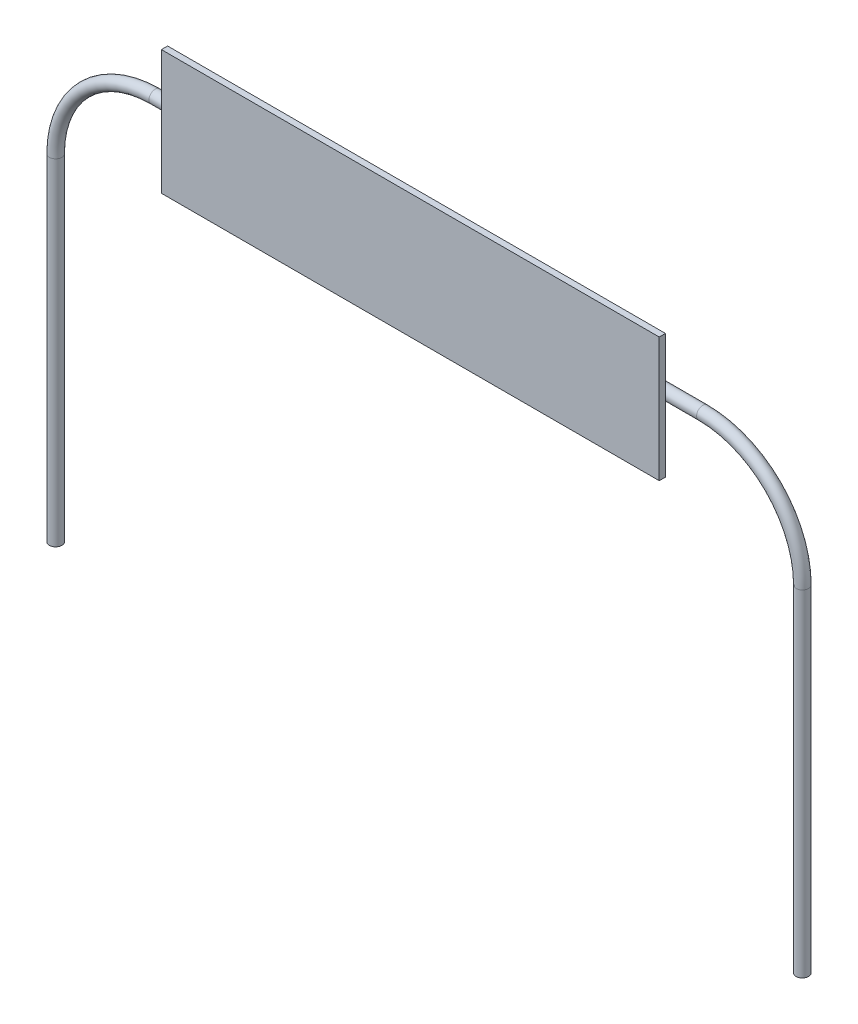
ISO-10303-21;
HEADER;
FILE_DESCRIPTION(('STEP AP214'),'2;1');
FILE_NAME('part.step','',(''),(''),'','','');
FILE_SCHEMA(('AUTOMOTIVE_DESIGN { 1 0 10303 214 1 1 1 1 }'));
ENDSEC;
DATA;
#1=APPLICATION_CONTEXT('core data for automotive mechanical design processes');
#2=APPLICATION_PROTOCOL_DEFINITION('international standard','automotive_design',2000,#1);
#3=PRODUCT_CONTEXT('',#1,'mechanical');
#4=PRODUCT('Part','Part','',(#3));
#5=PRODUCT_RELATED_PRODUCT_CATEGORY('part','',(#4));
#6=PRODUCT_DEFINITION_FORMATION('','',#4);
#7=PRODUCT_DEFINITION_CONTEXT('part definition',#1,'design');
#8=PRODUCT_DEFINITION('design','',#6,#7);
#9=PRODUCT_DEFINITION_SHAPE('','',#8);
#10=(LENGTH_UNIT() NAMED_UNIT(*) SI_UNIT(.MILLI.,.METRE.));
#11=(NAMED_UNIT(*) PLANE_ANGLE_UNIT() SI_UNIT($,.RADIAN.));
#12=(NAMED_UNIT(*) SI_UNIT($,.STERADIAN.) SOLID_ANGLE_UNIT());
#13=UNCERTAINTY_MEASURE_WITH_UNIT(LENGTH_MEASURE(1.E-05),#10,'distance_accuracy_value','');
#14=(GEOMETRIC_REPRESENTATION_CONTEXT(3) GLOBAL_UNCERTAINTY_ASSIGNED_CONTEXT((#13)) GLOBAL_UNIT_ASSIGNED_CONTEXT((#10,
#11,#12)) REPRESENTATION_CONTEXT('',''));
#15=CARTESIAN_POINT('',(0.,0.,0.));
#16=DIRECTION('',(0.,0.,1.));
#17=DIRECTION('',(1.,0.,0.));
#18=AXIS2_PLACEMENT_3D('',#15,#16,#17);
#19=CARTESIAN_POINT('',(-2895.6,-274.319999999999,30.4800000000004));
#20=DIRECTION('',(1.,0.,0.));
#21=DIRECTION('',(0.,0.,1.));
#22=AXIS2_PLACEMENT_3D('',#19,#20,#21);
#23=CYLINDRICAL_SURFACE('',#22,121.92);
#24=CARTESIAN_POINT('',(-2438.4,-274.319999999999,30.4800000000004));
#25=DIRECTION('',(1.,0.,0.));
#26=DIRECTION('',(0.,0.,-1.));
#27=AXIS2_PLACEMENT_3D('',#24,#25,#26);
#28=CIRCLE('',#27,121.92);
#29=CARTESIAN_POINT('',(-2438.4,-152.399999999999,30.4800000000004));
#30=VERTEX_POINT('',#29);
#31=CARTESIAN_POINT('',(-2438.4,-274.319999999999,152.4));
#32=VERTEX_POINT('',#31);
#33=EDGE_CURVE('E192',#30,#32,#28,.T.);
#34=ORIENTED_EDGE('',*,*,#33,.F.);
#35=DIRECTION('',(1.,0.,0.));
#36=VECTOR('',#35,1.);
#37=CARTESIAN_POINT('',(-2895.6,-152.399999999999,30.4800000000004));
#38=LINE('',#37,#36);
#39=CARTESIAN_POINT('',(-2895.6,-152.399999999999,30.4800000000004));
#40=VERTEX_POINT('',#39);
#41=EDGE_CURVE('E191',#40,#30,#38,.T.);
#42=ORIENTED_EDGE('',*,*,#41,.F.);
#43=CARTESIAN_POINT('',(-2895.6,-274.319999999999,30.4800000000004));
#44=DIRECTION('',(1.,0.,0.));
#45=DIRECTION('',(0.,0.,-1.));
#46=AXIS2_PLACEMENT_3D('',#43,#44,#45);
#47=CIRCLE('',#46,121.92);
#48=CARTESIAN_POINT('',(-2895.6,-274.319999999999,152.4));
#49=VERTEX_POINT('',#48);
#50=EDGE_CURVE('E234',#40,#49,#47,.T.);
#51=ORIENTED_EDGE('',*,*,#50,.T.);
#52=DIRECTION('',(1.,0.,0.));
#53=VECTOR('',#52,1.);
#54=CARTESIAN_POINT('',(-2895.6,-274.319999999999,152.4));
#55=LINE('',#54,#53);
#56=EDGE_CURVE('E12',#49,#32,#55,.T.);
#57=ORIENTED_EDGE('',*,*,#56,.T.);
#58=EDGE_LOOP('',(#34,#42,#51,#57));
#59=FACE_BOUND('',#58,.T.);
#60=ADVANCED_FACE('F48',(#59),#23,.T.);
#61=CARTESIAN_POINT('',(-2895.6,-274.319999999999,152.4));
#62=DIRECTION('',(0.,0.,-1.));
#63=DIRECTION('',(1.,0.,0.));
#64=AXIS2_PLACEMENT_3D('',#61,#62,#63);
#65=PLANE('',#64);
#66=DIRECTION('',(0.,-1.,0.));
#67=VECTOR('',#66,1.);
#68=CARTESIAN_POINT('',(-2438.4,-274.319999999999,152.4));
#69=LINE('',#68,#67);
#70=CARTESIAN_POINT('',(-2438.4,-457.199999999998,152.4));
#71=VERTEX_POINT('',#70);
#72=EDGE_CURVE('E194',#32,#71,#69,.T.);
#73=ORIENTED_EDGE('',*,*,#72,.F.);
#74=ORIENTED_EDGE('',*,*,#56,.F.);
#75=DIRECTION('',(0.,-1.,0.));
#76=VECTOR('',#75,1.);
#77=CARTESIAN_POINT('',(-2895.6,-274.319999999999,152.4));
#78=LINE('',#77,#76);
#79=CARTESIAN_POINT('',(-2895.6,-457.199999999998,152.4));
#80=VERTEX_POINT('',#79);
#81=EDGE_CURVE('E126',#49,#80,#78,.T.);
#82=ORIENTED_EDGE('',*,*,#81,.T.);
#83=DIRECTION('',(1.,0.,0.));
#84=VECTOR('',#83,1.);
#85=CARTESIAN_POINT('',(-2895.6,-457.199999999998,152.4));
#86=LINE('',#85,#84);
#87=EDGE_CURVE('E56',#80,#71,#86,.T.);
#88=ORIENTED_EDGE('',*,*,#87,.T.);
#89=EDGE_LOOP('',(#73,#74,#82,#88));
#90=FACE_BOUND('',#89,.T.);
#91=ADVANCED_FACE('F270',(#90),#65,.F.);
#92=CARTESIAN_POINT('',(-2895.6,-457.199999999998,60.9600000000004));
#93=DIRECTION('',(0.,1.,0.));
#94=DIRECTION('',(0.,0.,1.));
#95=AXIS2_PLACEMENT_3D('',#92,#93,#94);
#96=PLANE('',#95);
#97=DIRECTION('',(0.,0.,-1.));
#98=VECTOR('',#97,1.);
#99=CARTESIAN_POINT('',(-2438.4,-457.199999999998,60.9600000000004));
#100=LINE('',#99,#98);
#101=CARTESIAN_POINT('',(-2438.4,-457.199999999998,60.9600000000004));
#102=VERTEX_POINT('',#101);
#103=EDGE_CURVE('E197',#71,#102,#100,.T.);
#104=ORIENTED_EDGE('',*,*,#103,.F.);
#105=ORIENTED_EDGE('',*,*,#87,.F.);
#106=DIRECTION('',(0.,0.,-1.));
#107=VECTOR('',#106,1.);
#108=CARTESIAN_POINT('',(-2895.6,-457.199999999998,60.9600000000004));
#109=LINE('',#108,#107);
#110=CARTESIAN_POINT('',(-2895.6,-457.199999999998,60.9600000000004));
#111=VERTEX_POINT('',#110);
#112=EDGE_CURVE('E279',#80,#111,#109,.T.);
#113=ORIENTED_EDGE('',*,*,#112,.T.);
#114=DIRECTION('',(1.,0.,0.));
#115=VECTOR('',#114,1.);
#116=CARTESIAN_POINT('',(-2895.6,-457.199999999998,60.9600000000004));
#117=LINE('',#116,#115);
#118=EDGE_CURVE('E265',#111,#102,#117,.T.);
#119=ORIENTED_EDGE('',*,*,#118,.T.);
#120=EDGE_LOOP('',(#104,#105,#113,#119));
#121=FACE_BOUND('',#120,.T.);
#122=ADVANCED_FACE('F337',(#121),#96,.F.);
#123=CARTESIAN_POINT('',(-2895.6,-274.319999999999,60.9600000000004));
#124=DIRECTION('',(0.,0.,1.));
#125=DIRECTION('',(-1.,0.,0.));
#126=AXIS2_PLACEMENT_3D('',#123,#124,#125);
#127=PLANE('',#126);
#128=DIRECTION('',(0.,1.,0.));
#129=VECTOR('',#128,1.);
#130=CARTESIAN_POINT('',(-2438.4,-274.319999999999,60.9600000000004));
#131=LINE('',#130,#129);
#132=CARTESIAN_POINT('',(-2438.4,-274.319999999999,60.9600000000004));
#133=VERTEX_POINT('',#132);
#134=EDGE_CURVE('E200',#102,#133,#131,.T.);
#135=ORIENTED_EDGE('',*,*,#134,.F.);
#136=ORIENTED_EDGE('',*,*,#118,.F.);
#137=DIRECTION('',(0.,1.,0.));
#138=VECTOR('',#137,1.);
#139=CARTESIAN_POINT('',(-2895.6,-274.319999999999,60.9600000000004));
#140=LINE('',#139,#138);
#141=CARTESIAN_POINT('',(-2895.6,-274.319999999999,60.9600000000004));
#142=VERTEX_POINT('',#141);
#143=EDGE_CURVE('E283',#111,#142,#140,.T.);
#144=ORIENTED_EDGE('',*,*,#143,.T.);
#145=DIRECTION('',(1.,0.,0.));
#146=VECTOR('',#145,1.);
#147=CARTESIAN_POINT('',(-2895.6,-274.319999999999,60.9600000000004));
#148=LINE('',#147,#146);
#149=EDGE_CURVE('E262',#142,#133,#148,.T.);
#150=ORIENTED_EDGE('',*,*,#149,.T.);
#151=EDGE_LOOP('',(#135,#136,#144,#150));
#152=FACE_BOUND('',#151,.T.);
#153=ADVANCED_FACE('F336',(#152),#127,.F.);
#154=CARTESIAN_POINT('',(-2895.6,-274.319999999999,30.4800000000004));
#155=DIRECTION('',(1.,0.,0.));
#156=DIRECTION('',(0.,0.,1.));
#157=AXIS2_PLACEMENT_3D('',#154,#155,#156);
#158=CYLINDRICAL_SURFACE('',#157,30.48);
#159=CARTESIAN_POINT('',(-2438.4,-274.319999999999,30.4800000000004));
#160=DIRECTION('',(-1.,0.,0.));
#161=DIRECTION('',(0.,0.,-1.));
#162=AXIS2_PLACEMENT_3D('',#159,#160,#161);
#163=CIRCLE('',#162,30.48);
#164=CARTESIAN_POINT('',(-2438.4,-243.839999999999,30.4800000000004));
#165=VERTEX_POINT('',#164);
#166=EDGE_CURVE('E203',#133,#165,#163,.T.);
#167=ORIENTED_EDGE('',*,*,#166,.F.);
#168=ORIENTED_EDGE('',*,*,#149,.F.);
#169=CARTESIAN_POINT('',(-2895.6,-274.319999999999,30.4800000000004));
#170=DIRECTION('',(-1.,0.,0.));
#171=DIRECTION('',(0.,0.,-1.));
#172=AXIS2_PLACEMENT_3D('',#169,#170,#171);
#173=CIRCLE('',#172,30.48);
#174=CARTESIAN_POINT('',(-2895.6,-243.839999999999,30.4800000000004));
#175=VERTEX_POINT('',#174);
#176=EDGE_CURVE('E286',#142,#175,#173,.T.);
#177=ORIENTED_EDGE('',*,*,#176,.T.);
#178=DIRECTION('',(1.,0.,0.));
#179=VECTOR('',#178,1.);
#180=CARTESIAN_POINT('',(-2895.6,-243.839999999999,30.4800000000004));
#181=LINE('',#180,#179);
#182=EDGE_CURVE('E259',#175,#165,#181,.T.);
#183=ORIENTED_EDGE('',*,*,#182,.T.);
#184=EDGE_LOOP('',(#167,#168,#177,#183));
#185=FACE_BOUND('',#184,.T.);
#186=ADVANCED_FACE('F333',(#185),#158,.F.);
#187=CARTESIAN_POINT('',(-2895.6,-243.839999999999,0.));
#188=DIRECTION('',(0.,1.,0.));
#189=DIRECTION('',(0.,0.,1.));
#190=AXIS2_PLACEMENT_3D('',#187,#188,#189);
#191=PLANE('',#190);
#192=DIRECTION('',(0.,0.,-1.));
#193=VECTOR('',#192,1.);
#194=CARTESIAN_POINT('',(-2438.4,-243.839999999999,0.));
#195=LINE('',#194,#193);
#196=CARTESIAN_POINT('',(-2438.4,-243.84,0.));
#197=VERTEX_POINT('',#196);
#198=EDGE_CURVE('E206',#165,#197,#195,.T.);
#199=ORIENTED_EDGE('',*,*,#198,.F.);
#200=ORIENTED_EDGE('',*,*,#182,.F.);
#201=DIRECTION('',(0.,0.,-1.));
#202=VECTOR('',#201,1.);
#203=CARTESIAN_POINT('',(-2895.6,-243.839999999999,0.));
#204=LINE('',#203,#202);
#205=CARTESIAN_POINT('',(-2895.6,-243.84,0.));
#206=VERTEX_POINT('',#205);
#207=EDGE_CURVE('E289',#175,#206,#204,.T.);
#208=ORIENTED_EDGE('',*,*,#207,.T.);
#209=DIRECTION('',(1.,0.,0.));
#210=VECTOR('',#209,1.);
#211=CARTESIAN_POINT('',(-2895.6,-243.84,0.));
#212=LINE('',#211,#210);
#213=EDGE_CURVE('E256',#206,#197,#212,.T.);
#214=ORIENTED_EDGE('',*,*,#213,.T.);
#215=EDGE_LOOP('',(#199,#200,#208,#214));
#216=FACE_BOUND('',#215,.T.);
#217=ADVANCED_FACE('F331',(#216),#191,.F.);
#218=CARTESIAN_POINT('',(-2895.6,-1.77635683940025E-12,0.));
#219=DIRECTION('',(1.,0.,0.));
#220=DIRECTION('',(0.,0.,1.));
#221=AXIS2_PLACEMENT_3D('',#218,#219,#220);
#222=CYLINDRICAL_SURFACE('',#221,243.839999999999);
#223=CARTESIAN_POINT('',(-2438.4,-1.77635683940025E-12,0.));
#224=DIRECTION('',(1.,0.,0.));
#225=DIRECTION('',(0.,0.,-1.));
#226=AXIS2_PLACEMENT_3D('',#223,#224,#225);
#227=CIRCLE('',#226,243.839999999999);
#228=CARTESIAN_POINT('',(-2438.4,243.839999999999,0.));
#229=VERTEX_POINT('',#228);
#230=EDGE_CURVE('E209',#197,#229,#227,.T.);
#231=ORIENTED_EDGE('',*,*,#230,.F.);
#232=ORIENTED_EDGE('',*,*,#213,.F.);
#233=CARTESIAN_POINT('',(-2895.6,-1.77635683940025E-12,0.));
#234=DIRECTION('',(1.,0.,0.));
#235=DIRECTION('',(0.,0.,-1.));
#236=AXIS2_PLACEMENT_3D('',#233,#234,#235);
#237=CIRCLE('',#236,243.839999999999);
#238=CARTESIAN_POINT('',(-2895.6,243.839999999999,0.));
#239=VERTEX_POINT('',#238);
#240=EDGE_CURVE('E292',#206,#239,#237,.T.);
#241=ORIENTED_EDGE('',*,*,#240,.T.);
#242=DIRECTION('',(1.,0.,0.));
#243=VECTOR('',#242,1.);
#244=CARTESIAN_POINT('',(-2895.6,243.839999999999,0.));
#245=LINE('',#244,#243);
#246=EDGE_CURVE('E253',#239,#229,#245,.T.);
#247=ORIENTED_EDGE('',*,*,#246,.T.);
#248=EDGE_LOOP('',(#231,#232,#241,#247));
#249=FACE_BOUND('',#248,.T.);
#250=ADVANCED_FACE('F327',(#249),#222,.T.);
#251=CARTESIAN_POINT('',(-2895.6,243.839999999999,0.));
#252=DIRECTION('',(0.,-1.,0.));
#253=DIRECTION('',(0.,0.,-1.));
#254=AXIS2_PLACEMENT_3D('',#251,#252,#253);
#255=PLANE('',#254);
#256=DIRECTION('',(0.,0.,1.));
#257=VECTOR('',#256,1.);
#258=CARTESIAN_POINT('',(-2438.4,243.839999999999,0.));
#259=LINE('',#258,#257);
#260=CARTESIAN_POINT('',(-2438.4,243.839999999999,182.88));
#261=VERTEX_POINT('',#260);
#262=EDGE_CURVE('E212',#229,#261,#259,.T.);
#263=ORIENTED_EDGE('',*,*,#262,.F.);
#264=ORIENTED_EDGE('',*,*,#246,.F.);
#265=DIRECTION('',(0.,0.,1.));
#266=VECTOR('',#265,1.);
#267=CARTESIAN_POINT('',(-2895.6,243.839999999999,0.));
#268=LINE('',#267,#266);
#269=CARTESIAN_POINT('',(-2895.6,243.839999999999,182.88));
#270=VERTEX_POINT('',#269);
#271=EDGE_CURVE('E295',#239,#270,#268,.T.);
#272=ORIENTED_EDGE('',*,*,#271,.T.);
#273=DIRECTION('',(1.,0.,0.));
#274=VECTOR('',#273,1.);
#275=CARTESIAN_POINT('',(-2895.6,243.839999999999,182.88));
#276=LINE('',#275,#274);
#277=EDGE_CURVE('E250',#270,#261,#276,.T.);
#278=ORIENTED_EDGE('',*,*,#277,.T.);
#279=EDGE_LOOP('',(#263,#264,#272,#278));
#280=FACE_BOUND('',#279,.T.);
#281=ADVANCED_FACE('F324',(#280),#255,.F.);
#282=CARTESIAN_POINT('',(-2895.6,274.319999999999,182.88));
#283=DIRECTION('',(1.,0.,0.));
#284=DIRECTION('',(0.,0.,1.));
#285=AXIS2_PLACEMENT_3D('',#282,#283,#284);
#286=CYLINDRICAL_SURFACE('',#285,30.48);
#287=CARTESIAN_POINT('',(-2438.4,274.319999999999,182.88));
#288=DIRECTION('',(-1.,0.,0.));
#289=DIRECTION('',(0.,0.,1.));
#290=AXIS2_PLACEMENT_3D('',#287,#288,#289);
#291=CIRCLE('',#290,30.48);
#292=CARTESIAN_POINT('',(-2438.4,274.319999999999,213.36));
#293=VERTEX_POINT('',#292);
#294=EDGE_CURVE('E215',#261,#293,#291,.T.);
#295=ORIENTED_EDGE('',*,*,#294,.F.);
#296=ORIENTED_EDGE('',*,*,#277,.F.);
#297=CARTESIAN_POINT('',(-2895.6,274.319999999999,182.88));
#298=DIRECTION('',(-1.,0.,0.));
#299=DIRECTION('',(0.,0.,1.));
#300=AXIS2_PLACEMENT_3D('',#297,#298,#299);
#301=CIRCLE('',#300,30.48);
#302=CARTESIAN_POINT('',(-2895.6,274.319999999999,213.36));
#303=VERTEX_POINT('',#302);
#304=EDGE_CURVE('E298',#270,#303,#301,.T.);
#305=ORIENTED_EDGE('',*,*,#304,.T.);
#306=DIRECTION('',(1.,0.,0.));
#307=VECTOR('',#306,1.);
#308=CARTESIAN_POINT('',(-2895.6,274.319999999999,213.36));
#309=LINE('',#308,#307);
#310=EDGE_CURVE('E247',#303,#293,#309,.T.);
#311=ORIENTED_EDGE('',*,*,#310,.T.);
#312=EDGE_LOOP('',(#295,#296,#305,#311));
#313=FACE_BOUND('',#312,.T.);
#314=ADVANCED_FACE('F322',(#313),#286,.F.);
#315=CARTESIAN_POINT('',(-2895.6,274.319999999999,213.36));
#316=DIRECTION('',(0.,0.,1.));
#317=DIRECTION('',(-1.,0.,0.));
#318=AXIS2_PLACEMENT_3D('',#315,#316,#317);
#319=PLANE('',#318);
#320=DIRECTION('',(0.,1.,0.));
#321=VECTOR('',#320,1.);
#322=CARTESIAN_POINT('',(-2438.4,274.319999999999,213.36));
#323=LINE('',#322,#321);
#324=CARTESIAN_POINT('',(-2438.4,457.199999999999,213.36));
#325=VERTEX_POINT('',#324);
#326=EDGE_CURVE('E218',#293,#325,#323,.T.);
#327=ORIENTED_EDGE('',*,*,#326,.F.);
#328=ORIENTED_EDGE('',*,*,#310,.F.);
#329=DIRECTION('',(0.,1.,0.));
#330=VECTOR('',#329,1.);
#331=CARTESIAN_POINT('',(-2895.6,274.319999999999,213.36));
#332=LINE('',#331,#330);
#333=CARTESIAN_POINT('',(-2895.6,457.199999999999,213.36));
#334=VERTEX_POINT('',#333);
#335=EDGE_CURVE('E301',#303,#334,#332,.T.);
#336=ORIENTED_EDGE('',*,*,#335,.T.);
#337=DIRECTION('',(1.,0.,0.));
#338=VECTOR('',#337,1.);
#339=CARTESIAN_POINT('',(-2895.6,457.199999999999,213.36));
#340=LINE('',#339,#338);
#341=EDGE_CURVE('E244',#334,#325,#340,.T.);
#342=ORIENTED_EDGE('',*,*,#341,.T.);
#343=EDGE_LOOP('',(#327,#328,#336,#342));
#344=FACE_BOUND('',#343,.T.);
#345=ADVANCED_FACE('F318',(#344),#319,.F.);
#346=CARTESIAN_POINT('',(-2895.6,457.199999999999,213.36));
#347=DIRECTION('',(0.,-1.,0.));
#348=DIRECTION('',(0.,0.,-1.));
#349=AXIS2_PLACEMENT_3D('',#346,#347,#348);
#350=PLANE('',#349);
#351=DIRECTION('',(0.,0.,1.));
#352=VECTOR('',#351,1.);
#353=CARTESIAN_POINT('',(-2438.4,457.199999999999,213.36));
#354=LINE('',#353,#352);
#355=CARTESIAN_POINT('',(-2438.4,457.199999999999,304.8));
#356=VERTEX_POINT('',#355);
#357=EDGE_CURVE('E221',#325,#356,#354,.T.);
#358=ORIENTED_EDGE('',*,*,#357,.F.);
#359=ORIENTED_EDGE('',*,*,#341,.F.);
#360=DIRECTION('',(0.,0.,1.));
#361=VECTOR('',#360,1.);
#362=CARTESIAN_POINT('',(-2895.6,457.199999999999,213.36));
#363=LINE('',#362,#361);
#364=CARTESIAN_POINT('',(-2895.6,457.199999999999,304.8));
#365=VERTEX_POINT('',#364);
#366=EDGE_CURVE('E304',#334,#365,#363,.T.);
#367=ORIENTED_EDGE('',*,*,#366,.T.);
#368=DIRECTION('',(1.,0.,0.));
#369=VECTOR('',#368,1.);
#370=CARTESIAN_POINT('',(-2895.6,457.199999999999,304.8));
#371=LINE('',#370,#369);
#372=EDGE_CURVE('E241',#365,#356,#371,.T.);
#373=ORIENTED_EDGE('',*,*,#372,.T.);
#374=EDGE_LOOP('',(#358,#359,#367,#373));
#375=FACE_BOUND('',#374,.T.);
#376=ADVANCED_FACE('F315',(#375),#350,.F.);
#377=CARTESIAN_POINT('',(-2895.6,274.319999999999,304.8));
#378=DIRECTION('',(0.,0.,-1.));
#379=DIRECTION('',(0.,1.,0.));
#380=AXIS2_PLACEMENT_3D('',#377,#378,#379);
#381=PLANE('',#380);
#382=DIRECTION('',(0.,-1.,0.));
#383=VECTOR('',#382,1.);
#384=CARTESIAN_POINT('',(-2438.4,274.319999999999,304.8));
#385=LINE('',#384,#383);
#386=CARTESIAN_POINT('',(-2438.4,274.319999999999,304.8));
#387=VERTEX_POINT('',#386);
#388=EDGE_CURVE('E224',#356,#387,#385,.T.);
#389=ORIENTED_EDGE('',*,*,#388,.F.);
#390=ORIENTED_EDGE('',*,*,#372,.F.);
#391=DIRECTION('',(0.,-1.,0.));
#392=VECTOR('',#391,1.);
#393=CARTESIAN_POINT('',(-2895.6,274.319999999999,304.8));
#394=LINE('',#393,#392);
#395=CARTESIAN_POINT('',(-2895.6,274.319999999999,304.8));
#396=VERTEX_POINT('',#395);
#397=EDGE_CURVE('E186',#365,#396,#394,.T.);
#398=ORIENTED_EDGE('',*,*,#397,.T.);
#399=DIRECTION('',(1.,0.,0.));
#400=VECTOR('',#399,1.);
#401=CARTESIAN_POINT('',(-2895.6,274.319999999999,304.8));
#402=LINE('',#401,#400);
#403=EDGE_CURVE('E238',#396,#387,#402,.T.);
#404=ORIENTED_EDGE('',*,*,#403,.T.);
#405=EDGE_LOOP('',(#389,#390,#398,#404));
#406=FACE_BOUND('',#405,.T.);
#407=ADVANCED_FACE('F309',(#406),#381,.F.);
#408=CARTESIAN_POINT('',(-2895.6,274.319999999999,182.88));
#409=DIRECTION('',(1.,0.,0.));
#410=DIRECTION('',(0.,0.,1.));
#411=AXIS2_PLACEMENT_3D('',#408,#409,#410);
#412=CYLINDRICAL_SURFACE('',#411,121.92);
#413=CARTESIAN_POINT('',(-2438.4,274.319999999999,182.88));
#414=DIRECTION('',(1.,0.,0.));
#415=DIRECTION('',(0.,0.,1.));
#416=AXIS2_PLACEMENT_3D('',#413,#414,#415);
#417=CIRCLE('',#416,121.92);
#418=CARTESIAN_POINT('',(-2438.4,152.399999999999,182.88));
#419=VERTEX_POINT('',#418);
#420=EDGE_CURVE('E227',#387,#419,#417,.T.);
#421=ORIENTED_EDGE('',*,*,#420,.F.);
#422=ORIENTED_EDGE('',*,*,#403,.F.);
#423=CARTESIAN_POINT('',(-2895.6,274.319999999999,182.88));
#424=DIRECTION('',(1.,0.,0.));
#425=DIRECTION('',(0.,0.,1.));
#426=AXIS2_PLACEMENT_3D('',#423,#424,#425);
#427=CIRCLE('',#426,121.92);
#428=CARTESIAN_POINT('',(-2895.6,152.399999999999,182.88));
#429=VERTEX_POINT('',#428);
#430=EDGE_CURVE('E184',#396,#429,#427,.T.);
#431=ORIENTED_EDGE('',*,*,#430,.T.);
#432=DIRECTION('',(1.,0.,0.));
#433=VECTOR('',#432,1.);
#434=CARTESIAN_POINT('',(-2895.6,152.399999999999,182.88));
#435=LINE('',#434,#433);
#436=EDGE_CURVE('E178',#429,#419,#435,.T.);
#437=ORIENTED_EDGE('',*,*,#436,.T.);
#438=EDGE_LOOP('',(#421,#422,#431,#437));
#439=FACE_BOUND('',#438,.T.);
#440=ADVANCED_FACE('F313',(#439),#412,.T.);
#441=CARTESIAN_POINT('',(-2895.6,152.399999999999,0.));
#442=DIRECTION('',(0.,1.,0.));
#443=DIRECTION('',(0.,0.,1.));
#444=AXIS2_PLACEMENT_3D('',#441,#442,#443);
#445=PLANE('',#444);
#446=DIRECTION('',(0.,0.,-1.));
#447=VECTOR('',#446,1.);
#448=CARTESIAN_POINT('',(-2438.4,152.399999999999,0.));
#449=LINE('',#448,#447);
#450=CARTESIAN_POINT('',(-2438.4,152.399999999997,0.));
#451=VERTEX_POINT('',#450);
#452=EDGE_CURVE('E230',#419,#451,#449,.T.);
#453=ORIENTED_EDGE('',*,*,#452,.F.);
#454=ORIENTED_EDGE('',*,*,#436,.F.);
#455=DIRECTION('',(0.,0.,-1.));
#456=VECTOR('',#455,1.);
#457=CARTESIAN_POINT('',(-2895.6,152.399999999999,0.));
#458=LINE('',#457,#456);
#459=CARTESIAN_POINT('',(-2895.6,152.399999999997,0.));
#460=VERTEX_POINT('',#459);
#461=EDGE_CURVE('E168',#429,#460,#458,.T.);
#462=ORIENTED_EDGE('',*,*,#461,.T.);
#463=DIRECTION('',(1.,0.,0.));
#464=VECTOR('',#463,1.);
#465=CARTESIAN_POINT('',(-2895.6,152.399999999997,0.));
#466=LINE('',#465,#464);
#467=EDGE_CURVE('E173',#460,#451,#466,.T.);
#468=ORIENTED_EDGE('',*,*,#467,.T.);
#469=EDGE_LOOP('',(#453,#454,#462,#468));
#470=FACE_BOUND('',#469,.T.);
#471=ADVANCED_FACE('F181',(#470),#445,.F.);
#472=CARTESIAN_POINT('',(-2895.6,-1.77635683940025E-12,0.));
#473=DIRECTION('',(1.,0.,0.));
#474=DIRECTION('',(0.,0.,1.));
#475=AXIS2_PLACEMENT_3D('',#472,#473,#474);
#476=CYLINDRICAL_SURFACE('',#475,152.399999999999);
#477=CARTESIAN_POINT('',(-2438.4,-1.77635683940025E-12,0.));
#478=DIRECTION('',(-1.,0.,0.));
#479=DIRECTION('',(0.,0.,-1.));
#480=AXIS2_PLACEMENT_3D('',#477,#478,#479);
#481=CIRCLE('',#480,152.399999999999);
#482=CARTESIAN_POINT('',(-2438.4,-152.399999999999,0.));
#483=VERTEX_POINT('',#482);
#484=EDGE_CURVE('E175',#451,#483,#481,.T.);
#485=ORIENTED_EDGE('',*,*,#484,.F.);
#486=ORIENTED_EDGE('',*,*,#467,.F.);
#487=CARTESIAN_POINT('',(-2895.6,-1.77635683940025E-12,0.));
#488=DIRECTION('',(-1.,0.,0.));
#489=DIRECTION('',(0.,0.,-1.));
#490=AXIS2_PLACEMENT_3D('',#487,#488,#489);
#491=CIRCLE('',#490,152.399999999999);
#492=CARTESIAN_POINT('',(-2895.6,-152.399999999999,0.));
#493=VERTEX_POINT('',#492);
#494=EDGE_CURVE('E164',#460,#493,#491,.T.);
#495=ORIENTED_EDGE('',*,*,#494,.T.);
#496=DIRECTION('',(1.,0.,0.));
#497=VECTOR('',#496,1.);
#498=CARTESIAN_POINT('',(-2895.6,-152.399999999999,0.));
#499=LINE('',#498,#497);
#500=EDGE_CURVE('E179',#493,#483,#499,.T.);
#501=ORIENTED_EDGE('',*,*,#500,.T.);
#502=EDGE_LOOP('',(#485,#486,#495,#501));
#503=FACE_BOUND('',#502,.T.);
#504=ADVANCED_FACE('F174',(#503),#476,.F.);
#505=CARTESIAN_POINT('',(-2895.6,-152.399999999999,0.));
#506=DIRECTION('',(0.,-1.,0.));
#507=DIRECTION('',(0.,0.,-1.));
#508=AXIS2_PLACEMENT_3D('',#505,#506,#507);
#509=PLANE('',#508);
#510=DIRECTION('',(0.,0.,1.));
#511=VECTOR('',#510,1.);
#512=CARTESIAN_POINT('',(-2438.4,-152.399999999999,0.));
#513=LINE('',#512,#511);
#514=EDGE_CURVE('E114',#483,#30,#513,.T.);
#515=ORIENTED_EDGE('',*,*,#514,.F.);
#516=ORIENTED_EDGE('',*,*,#500,.F.);
#517=DIRECTION('',(0.,0.,1.));
#518=VECTOR('',#517,1.);
#519=CARTESIAN_POINT('',(-2895.6,-152.399999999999,0.));
#520=LINE('',#519,#518);
#521=EDGE_CURVE('E64',#493,#40,#520,.T.);
#522=ORIENTED_EDGE('',*,*,#521,.T.);
#523=ORIENTED_EDGE('',*,*,#41,.T.);
#524=EDGE_LOOP('',(#515,#516,#522,#523));
#525=FACE_BOUND('',#524,.T.);
#526=ADVANCED_FACE('F467',(#525),#509,.F.);
#527=CARTESIAN_POINT('',(-2895.6,-274.319999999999,30.4800000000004));
#528=DIRECTION('',(-1.,0.,0.));
#529=DIRECTION('',(0.,0.,-1.));
#530=AXIS2_PLACEMENT_3D('',#527,#528,#529);
#531=PLANE('',#530);
#532=ORIENTED_EDGE('',*,*,#50,.F.);
#533=ORIENTED_EDGE('',*,*,#521,.F.);
#534=ORIENTED_EDGE('',*,*,#494,.F.);
#535=ORIENTED_EDGE('',*,*,#461,.F.);
#536=ORIENTED_EDGE('',*,*,#430,.F.);
#537=ORIENTED_EDGE('',*,*,#397,.F.);
#538=ORIENTED_EDGE('',*,*,#366,.F.);
#539=ORIENTED_EDGE('',*,*,#335,.F.);
#540=ORIENTED_EDGE('',*,*,#304,.F.);
#541=ORIENTED_EDGE('',*,*,#271,.F.);
#542=ORIENTED_EDGE('',*,*,#240,.F.);
#543=ORIENTED_EDGE('',*,*,#207,.F.);
#544=ORIENTED_EDGE('',*,*,#176,.F.);
#545=ORIENTED_EDGE('',*,*,#143,.F.);
#546=ORIENTED_EDGE('',*,*,#112,.F.);
#547=ORIENTED_EDGE('',*,*,#81,.F.);
#548=EDGE_LOOP('',(#532,#533,#534,#535,#536,#537,#538,#539,#540,#541,#542,#543,#544,#545,#546,#547));
#549=FACE_BOUND('',#548,.T.);
#550=ADVANCED_FACE('F166',(#549),#531,.T.);
#551=CARTESIAN_POINT('',(-2438.4,-274.319999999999,30.4800000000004));
#552=DIRECTION('',(-1.,0.,0.));
#553=DIRECTION('',(0.,0.,-1.));
#554=AXIS2_PLACEMENT_3D('',#551,#552,#553);
#555=PLANE('',#554);
#556=ORIENTED_EDGE('',*,*,#33,.T.);
#557=ORIENTED_EDGE('',*,*,#72,.T.);
#558=ORIENTED_EDGE('',*,*,#103,.T.);
#559=ORIENTED_EDGE('',*,*,#134,.T.);
#560=ORIENTED_EDGE('',*,*,#166,.T.);
#561=ORIENTED_EDGE('',*,*,#198,.T.);
#562=ORIENTED_EDGE('',*,*,#230,.T.);
#563=ORIENTED_EDGE('',*,*,#262,.T.);
#564=ORIENTED_EDGE('',*,*,#294,.T.);
#565=ORIENTED_EDGE('',*,*,#326,.T.);
#566=ORIENTED_EDGE('',*,*,#357,.T.);
#567=ORIENTED_EDGE('',*,*,#388,.T.);
#568=ORIENTED_EDGE('',*,*,#420,.T.);
#569=ORIENTED_EDGE('',*,*,#452,.T.);
#570=ORIENTED_EDGE('',*,*,#484,.T.);
#571=ORIENTED_EDGE('',*,*,#514,.T.);
#572=EDGE_LOOP('',(#556,#557,#558,#559,#560,#561,#562,#563,#564,#565,#566,#567,#568,#569,#570,#571));
#573=FACE_BOUND('',#572,.T.);
#574=ADVANCED_FACE('F273',(#573),#555,.F.);
#575=CLOSED_SHELL('',(#60,#91,#122,#153,#186,#217,#250,#281,#314,#345,#376,#407,#440,#471,#504,
#526,#550,#574));
#576=MANIFOLD_SOLID_BREP('B2',#575);
#577=CARTESIAN_POINT('',(2895.6,-274.319999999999,30.4800000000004));
#578=DIRECTION('',(-1.,0.,0.));
#579=DIRECTION('',(0.,0.,1.));
#580=AXIS2_PLACEMENT_3D('',#577,#578,#579);
#581=CYLINDRICAL_SURFACE('',#580,121.92);
#582=CARTESIAN_POINT('',(2438.4,-274.319999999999,30.4800000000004));
#583=DIRECTION('',(1.,0.,0.));
#584=DIRECTION('',(0.,0.,-1.));
#585=AXIS2_PLACEMENT_3D('',#582,#583,#584);
#586=CIRCLE('',#585,121.92);
#587=CARTESIAN_POINT('',(2438.4,-152.399999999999,30.4800000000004));
#588=VERTEX_POINT('',#587);
#589=CARTESIAN_POINT('',(2438.4,-274.319999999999,152.4));
#590=VERTEX_POINT('',#589);
#591=EDGE_CURVE('E668',#588,#590,#586,.T.);
#592=ORIENTED_EDGE('',*,*,#591,.T.);
#593=DIRECTION('',(-1.,0.,0.));
#594=VECTOR('',#593,1.);
#595=CARTESIAN_POINT('',(2895.6,-274.319999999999,152.4));
#596=LINE('',#595,#594);
#597=CARTESIAN_POINT('',(2895.6,-274.319999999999,152.4));
#598=VERTEX_POINT('',#597);
#599=EDGE_CURVE('E46',#598,#590,#596,.T.);
#600=ORIENTED_EDGE('',*,*,#599,.F.);
#601=CARTESIAN_POINT('',(2895.6,-274.319999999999,30.4800000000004));
#602=DIRECTION('',(1.,0.,0.));
#603=DIRECTION('',(0.,0.,-1.));
#604=AXIS2_PLACEMENT_3D('',#601,#602,#603);
#605=CIRCLE('',#604,121.92);
#606=CARTESIAN_POINT('',(2895.6,-152.399999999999,30.4800000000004));
#607=VERTEX_POINT('',#606);
#608=EDGE_CURVE('E698',#607,#598,#605,.T.);
#609=ORIENTED_EDGE('',*,*,#608,.F.);
#610=DIRECTION('',(-1.,0.,0.));
#611=VECTOR('',#610,1.);
#612=CARTESIAN_POINT('',(2895.6,-152.399999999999,30.4800000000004));
#613=LINE('',#612,#611);
#614=EDGE_CURVE('E664',#607,#588,#613,.T.);
#615=ORIENTED_EDGE('',*,*,#614,.T.);
#616=EDGE_LOOP('',(#592,#600,#609,#615));
#617=FACE_BOUND('',#616,.T.);
#618=ADVANCED_FACE('F524',(#617),#581,.T.);
#619=CARTESIAN_POINT('',(2895.6,-274.319999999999,152.4));
#620=DIRECTION('',(0.,0.,-1.));
#621=DIRECTION('',(-1.,0.,0.));
#622=AXIS2_PLACEMENT_3D('',#619,#620,#621);
#623=PLANE('',#622);
#624=DIRECTION('',(0.,-1.,0.));
#625=VECTOR('',#624,1.);
#626=CARTESIAN_POINT('',(2438.4,-274.319999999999,152.4));
#627=LINE('',#626,#625);
#628=CARTESIAN_POINT('',(2438.4,-457.199999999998,152.4));
#629=VERTEX_POINT('',#628);
#630=EDGE_CURVE('E671',#590,#629,#627,.T.);
#631=ORIENTED_EDGE('',*,*,#630,.T.);
#632=DIRECTION('',(-1.,0.,0.));
#633=VECTOR('',#632,1.);
#634=CARTESIAN_POINT('',(2895.6,-457.199999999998,152.4));
#635=LINE('',#634,#633);
#636=CARTESIAN_POINT('',(2895.6,-457.199999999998,152.4));
#637=VERTEX_POINT('',#636);
#638=EDGE_CURVE('E532',#637,#629,#635,.T.);
#639=ORIENTED_EDGE('',*,*,#638,.F.);
#640=DIRECTION('',(0.,-1.,0.));
#641=VECTOR('',#640,1.);
#642=CARTESIAN_POINT('',(2895.6,-274.319999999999,152.4));
#643=LINE('',#642,#641);
#644=EDGE_CURVE('E607',#598,#637,#643,.T.);
#645=ORIENTED_EDGE('',*,*,#644,.F.);
#646=ORIENTED_EDGE('',*,*,#599,.T.);
#647=EDGE_LOOP('',(#631,#639,#645,#646));
#648=FACE_BOUND('',#647,.T.);
#649=ADVANCED_FACE('F796',(#648),#623,.F.);
#650=CARTESIAN_POINT('',(2895.6,-457.199999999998,60.9600000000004));
#651=DIRECTION('',(0.,1.,0.));
#652=DIRECTION('',(0.,0.,1.));
#653=AXIS2_PLACEMENT_3D('',#650,#651,#652);
#654=PLANE('',#653);
#655=DIRECTION('',(0.,0.,-1.));
#656=VECTOR('',#655,1.);
#657=CARTESIAN_POINT('',(2438.4,-457.199999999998,60.9600000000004));
#658=LINE('',#657,#656);
#659=CARTESIAN_POINT('',(2438.4,-457.199999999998,60.9600000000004));
#660=VERTEX_POINT('',#659);
#661=EDGE_CURVE('E673',#629,#660,#658,.T.);
#662=ORIENTED_EDGE('',*,*,#661,.T.);
#663=DIRECTION('',(-1.,0.,0.));
#664=VECTOR('',#663,1.);
#665=CARTESIAN_POINT('',(2895.6,-457.199999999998,60.9600000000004));
#666=LINE('',#665,#664);
#667=CARTESIAN_POINT('',(2895.6,-457.199999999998,60.9600000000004));
#668=VERTEX_POINT('',#667);
#669=EDGE_CURVE('E729',#668,#660,#666,.T.);
#670=ORIENTED_EDGE('',*,*,#669,.F.);
#671=DIRECTION('',(0.,0.,-1.));
#672=VECTOR('',#671,1.);
#673=CARTESIAN_POINT('',(2895.6,-457.199999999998,60.9600000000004));
#674=LINE('',#673,#672);
#675=EDGE_CURVE('E737',#637,#668,#674,.T.);
#676=ORIENTED_EDGE('',*,*,#675,.F.);
#677=ORIENTED_EDGE('',*,*,#638,.T.);
#678=EDGE_LOOP('',(#662,#670,#676,#677));
#679=FACE_BOUND('',#678,.T.);
#680=ADVANCED_FACE('F735',(#679),#654,.F.);
#681=CARTESIAN_POINT('',(2895.6,-274.319999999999,60.9600000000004));
#682=DIRECTION('',(0.,0.,1.));
#683=DIRECTION('',(1.,0.,0.));
#684=AXIS2_PLACEMENT_3D('',#681,#682,#683);
#685=PLANE('',#684);
#686=DIRECTION('',(0.,1.,0.));
#687=VECTOR('',#686,1.);
#688=CARTESIAN_POINT('',(2438.4,-274.319999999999,60.9600000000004));
#689=LINE('',#688,#687);
#690=CARTESIAN_POINT('',(2438.4,-274.319999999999,60.9600000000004));
#691=VERTEX_POINT('',#690);
#692=EDGE_CURVE('E675',#660,#691,#689,.T.);
#693=ORIENTED_EDGE('',*,*,#692,.T.);
#694=DIRECTION('',(-1.,0.,0.));
#695=VECTOR('',#694,1.);
#696=CARTESIAN_POINT('',(2895.6,-274.319999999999,60.9600000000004));
#697=LINE('',#696,#695);
#698=CARTESIAN_POINT('',(2895.6,-274.319999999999,60.9600000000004));
#699=VERTEX_POINT('',#698);
#700=EDGE_CURVE('E726',#699,#691,#697,.T.);
#701=ORIENTED_EDGE('',*,*,#700,.F.);
#702=DIRECTION('',(0.,1.,0.));
#703=VECTOR('',#702,1.);
#704=CARTESIAN_POINT('',(2895.6,-274.319999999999,60.9600000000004));
#705=LINE('',#704,#703);
#706=EDGE_CURVE('E755',#668,#699,#705,.T.);
#707=ORIENTED_EDGE('',*,*,#706,.F.);
#708=ORIENTED_EDGE('',*,*,#669,.T.);
#709=EDGE_LOOP('',(#693,#701,#707,#708));
#710=FACE_BOUND('',#709,.T.);
#711=ADVANCED_FACE('F746',(#710),#685,.F.);
#712=CARTESIAN_POINT('',(2895.6,-274.319999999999,30.4800000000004));
#713=DIRECTION('',(-1.,0.,0.));
#714=DIRECTION('',(0.,0.,1.));
#715=AXIS2_PLACEMENT_3D('',#712,#713,#714);
#716=CYLINDRICAL_SURFACE('',#715,30.48);
#717=CARTESIAN_POINT('',(2438.4,-274.319999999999,30.4800000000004));
#718=DIRECTION('',(-1.,0.,0.));
#719=DIRECTION('',(0.,0.,-1.));
#720=AXIS2_PLACEMENT_3D('',#717,#718,#719);
#721=CIRCLE('',#720,30.48);
#722=CARTESIAN_POINT('',(2438.4,-243.839999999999,30.4800000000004));
#723=VERTEX_POINT('',#722);
#724=EDGE_CURVE('E677',#691,#723,#721,.T.);
#725=ORIENTED_EDGE('',*,*,#724,.T.);
#726=DIRECTION('',(-1.,0.,0.));
#727=VECTOR('',#726,1.);
#728=CARTESIAN_POINT('',(2895.6,-243.839999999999,30.4800000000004));
#729=LINE('',#728,#727);
#730=CARTESIAN_POINT('',(2895.6,-243.839999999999,30.4800000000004));
#731=VERTEX_POINT('',#730);
#732=EDGE_CURVE('E723',#731,#723,#729,.T.);
#733=ORIENTED_EDGE('',*,*,#732,.F.);
#734=CARTESIAN_POINT('',(2895.6,-274.319999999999,30.4800000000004));
#735=DIRECTION('',(-1.,0.,0.));
#736=DIRECTION('',(0.,0.,-1.));
#737=AXIS2_PLACEMENT_3D('',#734,#735,#736);
#738=CIRCLE('',#737,30.48);
#739=EDGE_CURVE('E752',#699,#731,#738,.T.);
#740=ORIENTED_EDGE('',*,*,#739,.F.);
#741=ORIENTED_EDGE('',*,*,#700,.T.);
#742=EDGE_LOOP('',(#725,#733,#740,#741));
#743=FACE_BOUND('',#742,.T.);
#744=ADVANCED_FACE('F750',(#743),#716,.F.);
#745=CARTESIAN_POINT('',(2895.6,-243.839999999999,0.));
#746=DIRECTION('',(0.,1.,0.));
#747=DIRECTION('',(0.,0.,1.));
#748=AXIS2_PLACEMENT_3D('',#745,#746,#747);
#749=PLANE('',#748);
#750=DIRECTION('',(0.,0.,-1.));
#751=VECTOR('',#750,1.);
#752=CARTESIAN_POINT('',(2438.4,-243.839999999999,0.));
#753=LINE('',#752,#751);
#754=CARTESIAN_POINT('',(2438.4,-243.84,0.));
#755=VERTEX_POINT('',#754);
#756=EDGE_CURVE('E679',#723,#755,#753,.T.);
#757=ORIENTED_EDGE('',*,*,#756,.T.);
#758=DIRECTION('',(-1.,0.,0.));
#759=VECTOR('',#758,1.);
#760=CARTESIAN_POINT('',(2895.6,-243.84,0.));
#761=LINE('',#760,#759);
#762=CARTESIAN_POINT('',(2895.6,-243.84,0.));
#763=VERTEX_POINT('',#762);
#764=EDGE_CURVE('E720',#763,#755,#761,.T.);
#765=ORIENTED_EDGE('',*,*,#764,.F.);
#766=DIRECTION('',(0.,0.,-1.));
#767=VECTOR('',#766,1.);
#768=CARTESIAN_POINT('',(2895.6,-243.839999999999,0.));
#769=LINE('',#768,#767);
#770=EDGE_CURVE('E754',#731,#763,#769,.T.);
#771=ORIENTED_EDGE('',*,*,#770,.F.);
#772=ORIENTED_EDGE('',*,*,#732,.T.);
#773=EDGE_LOOP('',(#757,#765,#771,#772));
#774=FACE_BOUND('',#773,.T.);
#775=ADVANCED_FACE('F809',(#774),#749,.F.);
#776=CARTESIAN_POINT('',(2895.6,-1.77635683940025E-12,0.));
#777=DIRECTION('',(-1.,0.,0.));
#778=DIRECTION('',(0.,0.,1.));
#779=AXIS2_PLACEMENT_3D('',#776,#777,#778);
#780=CYLINDRICAL_SURFACE('',#779,243.839999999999);
#781=CARTESIAN_POINT('',(2438.4,-1.77635683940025E-12,0.));
#782=DIRECTION('',(1.,0.,0.));
#783=DIRECTION('',(0.,0.,-1.));
#784=AXIS2_PLACEMENT_3D('',#781,#782,#783);
#785=CIRCLE('',#784,243.839999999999);
#786=CARTESIAN_POINT('',(2438.4,243.839999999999,0.));
#787=VERTEX_POINT('',#786);
#788=EDGE_CURVE('E681',#755,#787,#785,.T.);
#789=ORIENTED_EDGE('',*,*,#788,.T.);
#790=DIRECTION('',(-1.,0.,0.));
#791=VECTOR('',#790,1.);
#792=CARTESIAN_POINT('',(2895.6,243.839999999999,0.));
#793=LINE('',#792,#791);
#794=CARTESIAN_POINT('',(2895.6,243.839999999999,0.));
#795=VERTEX_POINT('',#794);
#796=EDGE_CURVE('E717',#795,#787,#793,.T.);
#797=ORIENTED_EDGE('',*,*,#796,.F.);
#798=CARTESIAN_POINT('',(2895.6,-1.77635683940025E-12,0.));
#799=DIRECTION('',(1.,0.,0.));
#800=DIRECTION('',(0.,0.,-1.));
#801=AXIS2_PLACEMENT_3D('',#798,#799,#800);
#802=CIRCLE('',#801,243.839999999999);
#803=EDGE_CURVE('E757',#763,#795,#802,.T.);
#804=ORIENTED_EDGE('',*,*,#803,.F.);
#805=ORIENTED_EDGE('',*,*,#764,.T.);
#806=EDGE_LOOP('',(#789,#797,#804,#805));
#807=FACE_BOUND('',#806,.T.);
#808=ADVANCED_FACE('F812',(#807),#780,.T.);
#809=CARTESIAN_POINT('',(2895.6,243.839999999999,0.));
#810=DIRECTION('',(0.,-1.,0.));
#811=DIRECTION('',(0.,0.,-1.));
#812=AXIS2_PLACEMENT_3D('',#809,#810,#811);
#813=PLANE('',#812);
#814=DIRECTION('',(0.,0.,1.));
#815=VECTOR('',#814,1.);
#816=CARTESIAN_POINT('',(2438.4,243.839999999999,0.));
#817=LINE('',#816,#815);
#818=CARTESIAN_POINT('',(2438.4,243.839999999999,182.88));
#819=VERTEX_POINT('',#818);
#820=EDGE_CURVE('E683',#787,#819,#817,.T.);
#821=ORIENTED_EDGE('',*,*,#820,.T.);
#822=DIRECTION('',(-1.,0.,0.));
#823=VECTOR('',#822,1.);
#824=CARTESIAN_POINT('',(2895.6,243.839999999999,182.88));
#825=LINE('',#824,#823);
#826=CARTESIAN_POINT('',(2895.6,243.839999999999,182.88));
#827=VERTEX_POINT('',#826);
#828=EDGE_CURVE('E714',#827,#819,#825,.T.);
#829=ORIENTED_EDGE('',*,*,#828,.F.);
#830=DIRECTION('',(0.,0.,1.));
#831=VECTOR('',#830,1.);
#832=CARTESIAN_POINT('',(2895.6,243.839999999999,0.));
#833=LINE('',#832,#831);
#834=EDGE_CURVE('E763',#795,#827,#833,.T.);
#835=ORIENTED_EDGE('',*,*,#834,.F.);
#836=ORIENTED_EDGE('',*,*,#796,.T.);
#837=EDGE_LOOP('',(#821,#829,#835,#836));
#838=FACE_BOUND('',#837,.T.);
#839=ADVANCED_FACE('F816',(#838),#813,.F.);
#840=CARTESIAN_POINT('',(2895.6,274.319999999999,182.88));
#841=DIRECTION('',(-1.,0.,0.));
#842=DIRECTION('',(0.,0.,1.));
#843=AXIS2_PLACEMENT_3D('',#840,#841,#842);
#844=CYLINDRICAL_SURFACE('',#843,30.48);
#845=CARTESIAN_POINT('',(2438.4,274.319999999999,182.88));
#846=DIRECTION('',(-1.,0.,0.));
#847=DIRECTION('',(0.,0.,1.));
#848=AXIS2_PLACEMENT_3D('',#845,#846,#847);
#849=CIRCLE('',#848,30.48);
#850=CARTESIAN_POINT('',(2438.4,274.319999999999,213.36));
#851=VERTEX_POINT('',#850);
#852=EDGE_CURVE('E685',#819,#851,#849,.T.);
#853=ORIENTED_EDGE('',*,*,#852,.T.);
#854=DIRECTION('',(-1.,0.,0.));
#855=VECTOR('',#854,1.);
#856=CARTESIAN_POINT('',(2895.6,274.319999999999,213.36));
#857=LINE('',#856,#855);
#858=CARTESIAN_POINT('',(2895.6,274.319999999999,213.36));
#859=VERTEX_POINT('',#858);
#860=EDGE_CURVE('E711',#859,#851,#857,.T.);
#861=ORIENTED_EDGE('',*,*,#860,.F.);
#862=CARTESIAN_POINT('',(2895.6,274.319999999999,182.88));
#863=DIRECTION('',(-1.,0.,0.));
#864=DIRECTION('',(0.,0.,1.));
#865=AXIS2_PLACEMENT_3D('',#862,#863,#864);
#866=CIRCLE('',#865,30.48);
#867=EDGE_CURVE('E765',#827,#859,#866,.T.);
#868=ORIENTED_EDGE('',*,*,#867,.F.);
#869=ORIENTED_EDGE('',*,*,#828,.T.);
#870=EDGE_LOOP('',(#853,#861,#868,#869));
#871=FACE_BOUND('',#870,.T.);
#872=ADVANCED_FACE('F820',(#871),#844,.F.);
#873=CARTESIAN_POINT('',(2895.6,274.319999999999,213.36));
#874=DIRECTION('',(0.,0.,1.));
#875=DIRECTION('',(1.,0.,0.));
#876=AXIS2_PLACEMENT_3D('',#873,#874,#875);
#877=PLANE('',#876);
#878=DIRECTION('',(0.,1.,0.));
#879=VECTOR('',#878,1.);
#880=CARTESIAN_POINT('',(2438.4,274.319999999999,213.36));
#881=LINE('',#880,#879);
#882=CARTESIAN_POINT('',(2438.4,457.199999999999,213.36));
#883=VERTEX_POINT('',#882);
#884=EDGE_CURVE('E687',#851,#883,#881,.T.);
#885=ORIENTED_EDGE('',*,*,#884,.T.);
#886=DIRECTION('',(-1.,0.,0.));
#887=VECTOR('',#886,1.);
#888=CARTESIAN_POINT('',(2895.6,457.199999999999,213.36));
#889=LINE('',#888,#887);
#890=CARTESIAN_POINT('',(2895.6,457.199999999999,213.36));
#891=VERTEX_POINT('',#890);
#892=EDGE_CURVE('E708',#891,#883,#889,.T.);
#893=ORIENTED_EDGE('',*,*,#892,.F.);
#894=DIRECTION('',(0.,1.,0.));
#895=VECTOR('',#894,1.);
#896=CARTESIAN_POINT('',(2895.6,274.319999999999,213.36));
#897=LINE('',#896,#895);
#898=EDGE_CURVE('E767',#859,#891,#897,.T.);
#899=ORIENTED_EDGE('',*,*,#898,.F.);
#900=ORIENTED_EDGE('',*,*,#860,.T.);
#901=EDGE_LOOP('',(#885,#893,#899,#900));
#902=FACE_BOUND('',#901,.T.);
#903=ADVANCED_FACE('F824',(#902),#877,.F.);
#904=CARTESIAN_POINT('',(2895.6,457.199999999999,213.36));
#905=DIRECTION('',(0.,-1.,0.));
#906=DIRECTION('',(0.,0.,-1.));
#907=AXIS2_PLACEMENT_3D('',#904,#905,#906);
#908=PLANE('',#907);
#909=DIRECTION('',(0.,0.,1.));
#910=VECTOR('',#909,1.);
#911=CARTESIAN_POINT('',(2438.4,457.199999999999,213.36));
#912=LINE('',#911,#910);
#913=CARTESIAN_POINT('',(2438.4,457.199999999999,304.8));
#914=VERTEX_POINT('',#913);
#915=EDGE_CURVE('E689',#883,#914,#912,.T.);
#916=ORIENTED_EDGE('',*,*,#915,.T.);
#917=DIRECTION('',(-1.,0.,0.));
#918=VECTOR('',#917,1.);
#919=CARTESIAN_POINT('',(2895.6,457.199999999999,304.8));
#920=LINE('',#919,#918);
#921=CARTESIAN_POINT('',(2895.6,457.199999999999,304.8));
#922=VERTEX_POINT('',#921);
#923=EDGE_CURVE('E705',#922,#914,#920,.T.);
#924=ORIENTED_EDGE('',*,*,#923,.F.);
#925=DIRECTION('',(0.,0.,1.));
#926=VECTOR('',#925,1.);
#927=CARTESIAN_POINT('',(2895.6,457.199999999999,213.36));
#928=LINE('',#927,#926);
#929=EDGE_CURVE('E769',#891,#922,#928,.T.);
#930=ORIENTED_EDGE('',*,*,#929,.F.);
#931=ORIENTED_EDGE('',*,*,#892,.T.);
#932=EDGE_LOOP('',(#916,#924,#930,#931));
#933=FACE_BOUND('',#932,.T.);
#934=ADVANCED_FACE('F828',(#933),#908,.F.);
#935=CARTESIAN_POINT('',(2895.6,274.319999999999,304.8));
#936=DIRECTION('',(0.,0.,-1.));
#937=DIRECTION('',(0.,1.,0.));
#938=AXIS2_PLACEMENT_3D('',#935,#936,#937);
#939=PLANE('',#938);
#940=DIRECTION('',(0.,-1.,0.));
#941=VECTOR('',#940,1.);
#942=CARTESIAN_POINT('',(2438.4,274.319999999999,304.8));
#943=LINE('',#942,#941);
#944=CARTESIAN_POINT('',(2438.4,274.319999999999,304.8));
#945=VERTEX_POINT('',#944);
#946=EDGE_CURVE('E691',#914,#945,#943,.T.);
#947=ORIENTED_EDGE('',*,*,#946,.T.);
#948=DIRECTION('',(-1.,0.,0.));
#949=VECTOR('',#948,1.);
#950=CARTESIAN_POINT('',(2895.6,274.319999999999,304.8));
#951=LINE('',#950,#949);
#952=CARTESIAN_POINT('',(2895.6,274.319999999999,304.8));
#953=VERTEX_POINT('',#952);
#954=EDGE_CURVE('E702',#953,#945,#951,.T.);
#955=ORIENTED_EDGE('',*,*,#954,.F.);
#956=DIRECTION('',(0.,-1.,0.));
#957=VECTOR('',#956,1.);
#958=CARTESIAN_POINT('',(2895.6,274.319999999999,304.8));
#959=LINE('',#958,#957);
#960=EDGE_CURVE('E771',#922,#953,#959,.T.);
#961=ORIENTED_EDGE('',*,*,#960,.F.);
#962=ORIENTED_EDGE('',*,*,#923,.T.);
#963=EDGE_LOOP('',(#947,#955,#961,#962));
#964=FACE_BOUND('',#963,.T.);
#965=ADVANCED_FACE('F777',(#964),#939,.F.);
#966=CARTESIAN_POINT('',(2895.6,274.319999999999,182.88));
#967=DIRECTION('',(-1.,0.,0.));
#968=DIRECTION('',(0.,0.,1.));
#969=AXIS2_PLACEMENT_3D('',#966,#967,#968);
#970=CYLINDRICAL_SURFACE('',#969,121.92);
#971=CARTESIAN_POINT('',(2438.4,274.319999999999,182.88));
#972=DIRECTION('',(1.,0.,0.));
#973=DIRECTION('',(0.,0.,1.));
#974=AXIS2_PLACEMENT_3D('',#971,#972,#973);
#975=CIRCLE('',#974,121.92);
#976=CARTESIAN_POINT('',(2438.4,152.399999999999,182.88));
#977=VERTEX_POINT('',#976);
#978=EDGE_CURVE('E693',#945,#977,#975,.T.);
#979=ORIENTED_EDGE('',*,*,#978,.T.);
#980=DIRECTION('',(-1.,0.,0.));
#981=VECTOR('',#980,1.);
#982=CARTESIAN_POINT('',(2895.6,152.399999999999,182.88));
#983=LINE('',#982,#981);
#984=CARTESIAN_POINT('',(2895.6,152.399999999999,182.88));
#985=VERTEX_POINT('',#984);
#986=EDGE_CURVE('E659',#985,#977,#983,.T.);
#987=ORIENTED_EDGE('',*,*,#986,.F.);
#988=CARTESIAN_POINT('',(2895.6,274.319999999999,182.88));
#989=DIRECTION('',(1.,0.,0.));
#990=DIRECTION('',(0.,0.,1.));
#991=AXIS2_PLACEMENT_3D('',#988,#989,#990);
#992=CIRCLE('',#991,121.92);
#993=EDGE_CURVE('E650',#953,#985,#992,.T.);
#994=ORIENTED_EDGE('',*,*,#993,.F.);
#995=ORIENTED_EDGE('',*,*,#954,.T.);
#996=EDGE_LOOP('',(#979,#987,#994,#995));
#997=FACE_BOUND('',#996,.T.);
#998=ADVANCED_FACE('F781',(#997),#970,.T.);
#999=CARTESIAN_POINT('',(2895.6,152.399999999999,0.));
#1000=DIRECTION('',(0.,1.,0.));
#1001=DIRECTION('',(0.,0.,1.));
#1002=AXIS2_PLACEMENT_3D('',#999,#1000,#1001);
#1003=PLANE('',#1002);
#1004=DIRECTION('',(0.,0.,-1.));
#1005=VECTOR('',#1004,1.);
#1006=CARTESIAN_POINT('',(2438.4,152.399999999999,0.));
#1007=LINE('',#1006,#1005);
#1008=CARTESIAN_POINT('',(2438.4,152.399999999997,0.));
#1009=VERTEX_POINT('',#1008);
#1010=EDGE_CURVE('E658',#977,#1009,#1007,.T.);
#1011=ORIENTED_EDGE('',*,*,#1010,.T.);
#1012=DIRECTION('',(-1.,0.,0.));
#1013=VECTOR('',#1012,1.);
#1014=CARTESIAN_POINT('',(2895.6,152.399999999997,0.));
#1015=LINE('',#1014,#1013);
#1016=CARTESIAN_POINT('',(2895.6,152.399999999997,0.));
#1017=VERTEX_POINT('',#1016);
#1018=EDGE_CURVE('E655',#1017,#1009,#1015,.T.);
#1019=ORIENTED_EDGE('',*,*,#1018,.F.);
#1020=DIRECTION('',(0.,0.,-1.));
#1021=VECTOR('',#1020,1.);
#1022=CARTESIAN_POINT('',(2895.6,152.399999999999,0.));
#1023=LINE('',#1022,#1021);
#1024=EDGE_CURVE('E644',#985,#1017,#1023,.T.);
#1025=ORIENTED_EDGE('',*,*,#1024,.F.);
#1026=ORIENTED_EDGE('',*,*,#986,.T.);
#1027=EDGE_LOOP('',(#1011,#1019,#1025,#1026));
#1028=FACE_BOUND('',#1027,.T.);
#1029=ADVANCED_FACE('F656',(#1028),#1003,.F.);
#1030=CARTESIAN_POINT('',(2895.6,-1.77635683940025E-12,0.));
#1031=DIRECTION('',(-1.,0.,0.));
#1032=DIRECTION('',(0.,0.,1.));
#1033=AXIS2_PLACEMENT_3D('',#1030,#1031,#1032);
#1034=CYLINDRICAL_SURFACE('',#1033,152.399999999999);
#1035=CARTESIAN_POINT('',(2438.4,-1.77635683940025E-12,0.));
#1036=DIRECTION('',(-1.,0.,0.));
#1037=DIRECTION('',(0.,0.,-1.));
#1038=AXIS2_PLACEMENT_3D('',#1035,#1036,#1037);
#1039=CIRCLE('',#1038,152.399999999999);
#1040=CARTESIAN_POINT('',(2438.4,-152.399999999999,0.));
#1041=VERTEX_POINT('',#1040);
#1042=EDGE_CURVE('E593',#1009,#1041,#1039,.T.);
#1043=ORIENTED_EDGE('',*,*,#1042,.T.);
#1044=DIRECTION('',(-1.,0.,0.));
#1045=VECTOR('',#1044,1.);
#1046=CARTESIAN_POINT('',(2895.6,-152.399999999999,0.));
#1047=LINE('',#1046,#1045);
#1048=CARTESIAN_POINT('',(2895.6,-152.399999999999,0.));
#1049=VERTEX_POINT('',#1048);
#1050=EDGE_CURVE('E660',#1049,#1041,#1047,.T.);
#1051=ORIENTED_EDGE('',*,*,#1050,.F.);
#1052=CARTESIAN_POINT('',(2895.6,-1.77635683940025E-12,0.));
#1053=DIRECTION('',(-1.,0.,0.));
#1054=DIRECTION('',(0.,0.,-1.));
#1055=AXIS2_PLACEMENT_3D('',#1052,#1053,#1054);
#1056=CIRCLE('',#1055,152.399999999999);
#1057=EDGE_CURVE('E648',#1017,#1049,#1056,.T.);
#1058=ORIENTED_EDGE('',*,*,#1057,.F.);
#1059=ORIENTED_EDGE('',*,*,#1018,.T.);
#1060=EDGE_LOOP('',(#1043,#1051,#1058,#1059));
#1061=FACE_BOUND('',#1060,.T.);
#1062=ADVANCED_FACE('F662',(#1061),#1034,.F.);
#1063=CARTESIAN_POINT('',(2895.6,-152.399999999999,0.));
#1064=DIRECTION('',(0.,-1.,0.));
#1065=DIRECTION('',(0.,0.,-1.));
#1066=AXIS2_PLACEMENT_3D('',#1063,#1064,#1065);
#1067=PLANE('',#1066);
#1068=DIRECTION('',(0.,0.,1.));
#1069=VECTOR('',#1068,1.);
#1070=CARTESIAN_POINT('',(2438.4,-152.399999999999,0.));
#1071=LINE('',#1070,#1069);
#1072=EDGE_CURVE('E599',#1041,#588,#1071,.T.);
#1073=ORIENTED_EDGE('',*,*,#1072,.T.);
#1074=ORIENTED_EDGE('',*,*,#614,.F.);
#1075=DIRECTION('',(0.,0.,1.));
#1076=VECTOR('',#1075,1.);
#1077=CARTESIAN_POINT('',(2895.6,-152.399999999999,0.));
#1078=LINE('',#1077,#1076);
#1079=EDGE_CURVE('E540',#1049,#607,#1078,.T.);
#1080=ORIENTED_EDGE('',*,*,#1079,.F.);
#1081=ORIENTED_EDGE('',*,*,#1050,.T.);
#1082=EDGE_LOOP('',(#1073,#1074,#1080,#1081));
#1083=FACE_BOUND('',#1082,.T.);
#1084=ADVANCED_FACE('F785',(#1083),#1067,.F.);
#1085=CARTESIAN_POINT('',(2895.6,-274.319999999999,30.4800000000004));
#1086=DIRECTION('',(1.,0.,0.));
#1087=DIRECTION('',(0.,0.,-1.));
#1088=AXIS2_PLACEMENT_3D('',#1085,#1086,#1087);
#1089=PLANE('',#1088);
#1090=ORIENTED_EDGE('',*,*,#608,.T.);
#1091=ORIENTED_EDGE('',*,*,#644,.T.);
#1092=ORIENTED_EDGE('',*,*,#675,.T.);
#1093=ORIENTED_EDGE('',*,*,#706,.T.);
#1094=ORIENTED_EDGE('',*,*,#739,.T.);
#1095=ORIENTED_EDGE('',*,*,#770,.T.);
#1096=ORIENTED_EDGE('',*,*,#803,.T.);
#1097=ORIENTED_EDGE('',*,*,#834,.T.);
#1098=ORIENTED_EDGE('',*,*,#867,.T.);
#1099=ORIENTED_EDGE('',*,*,#898,.T.);
#1100=ORIENTED_EDGE('',*,*,#929,.T.);
#1101=ORIENTED_EDGE('',*,*,#960,.T.);
#1102=ORIENTED_EDGE('',*,*,#993,.T.);
#1103=ORIENTED_EDGE('',*,*,#1024,.T.);
#1104=ORIENTED_EDGE('',*,*,#1057,.T.);
#1105=ORIENTED_EDGE('',*,*,#1079,.T.);
#1106=EDGE_LOOP('',(#1090,#1091,#1092,#1093,#1094,#1095,#1096,#1097,#1098,#1099,#1100,#1101,
#1102,#1103,#1104,#1105));
#1107=FACE_BOUND('',#1106,.T.);
#1108=ADVANCED_FACE('F646',(#1107),#1089,.T.);
#1109=CARTESIAN_POINT('',(2438.4,-274.319999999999,30.4800000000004));
#1110=DIRECTION('',(1.,0.,0.));
#1111=DIRECTION('',(0.,0.,-1.));
#1112=AXIS2_PLACEMENT_3D('',#1109,#1110,#1111);
#1113=PLANE('',#1112);
#1114=ORIENTED_EDGE('',*,*,#591,.F.);
#1115=ORIENTED_EDGE('',*,*,#1072,.F.);
#1116=ORIENTED_EDGE('',*,*,#1042,.F.);
#1117=ORIENTED_EDGE('',*,*,#1010,.F.);
#1118=ORIENTED_EDGE('',*,*,#978,.F.);
#1119=ORIENTED_EDGE('',*,*,#946,.F.);
#1120=ORIENTED_EDGE('',*,*,#915,.F.);
#1121=ORIENTED_EDGE('',*,*,#884,.F.);
#1122=ORIENTED_EDGE('',*,*,#852,.F.);
#1123=ORIENTED_EDGE('',*,*,#820,.F.);
#1124=ORIENTED_EDGE('',*,*,#788,.F.);
#1125=ORIENTED_EDGE('',*,*,#756,.F.);
#1126=ORIENTED_EDGE('',*,*,#724,.F.);
#1127=ORIENTED_EDGE('',*,*,#692,.F.);
#1128=ORIENTED_EDGE('',*,*,#661,.F.);
#1129=ORIENTED_EDGE('',*,*,#630,.F.);
#1130=EDGE_LOOP('',(#1114,#1115,#1116,#1117,#1118,#1119,#1120,#1121,#1122,#1123,#1124,#1125,
#1126,#1127,#1128,#1129));
#1131=FACE_BOUND('',#1130,.T.);
#1132=ADVANCED_FACE('F741',(#1131),#1113,.F.);
#1133=CLOSED_SHELL('',(#618,#649,#680,#711,#744,#775,#808,#839,#872,#903,#934,#965,#998,#1029,
#1062,#1084,#1108,#1132));
#1134=MANIFOLD_SOLID_BREP('B6',#1133);
#1135=CARTESIAN_POINT('',(-9144.,-2438.40000000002,0.));
#1136=DIRECTION('',(0.,-1.,0.));
#1137=DIRECTION('',(1.,0.,0.));
#1138=AXIS2_PLACEMENT_3D('',#1135,#1136,#1137);
#1139=CYLINDRICAL_SURFACE('',#1138,152.4);
#1140=CARTESIAN_POINT('',(-9144.,-2438.40000000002,0.));
#1141=DIRECTION('',(0.,-1.,0.));
#1142=DIRECTION('',(0.,0.,1.));
#1143=AXIS2_PLACEMENT_3D('',#1140,#1141,#1142);
#1144=CIRCLE('',#1143,152.4);
#1145=CARTESIAN_POINT('',(-9296.4,-2438.40000000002,0.));
#1146=VERTEX_POINT('',#1145);
#1147=EDGE_CURVE('E1007',#1146,#1146,#1144,.T.);
#1148=ORIENTED_EDGE('',*,*,#1147,.T.);
#1149=EDGE_LOOP('',(#1148));
#1150=FACE_BOUND('',#1149,.T.);
#1151=CARTESIAN_POINT('',(-9144.,-10668.,0.));
#1152=DIRECTION('',(0.,-1.,0.));
#1153=DIRECTION('',(0.,0.,1.));
#1154=AXIS2_PLACEMENT_3D('',#1151,#1152,#1153);
#1155=CIRCLE('',#1154,152.4);
#1156=CARTESIAN_POINT('',(-9144.,-10668.,152.4));
#1157=VERTEX_POINT('',#1156);
#1158=EDGE_CURVE('E523',#1157,#1157,#1155,.T.);
#1159=ORIENTED_EDGE('',*,*,#1158,.F.);
#1160=EDGE_LOOP('',(#1159));
#1161=FACE_BOUND('',#1160,.T.);
#1162=ADVANCED_FACE('F1001',(#1150,#1161),#1139,.T.);
#1163=CARTESIAN_POINT('',(-6705.6,-2438.4,0.));
#1164=DIRECTION('',(0.,0.,1.));
#1165=DIRECTION('',(1.,0.,0.));
#1166=AXIS2_PLACEMENT_3D('',#1163,#1164,#1165);
#1167=TOROIDAL_SURFACE('',#1166,2438.4,152.4);
#1168=CARTESIAN_POINT('',(-6705.59999999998,-2.81000659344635E-12,0.));
#1169=DIRECTION('',(-1.,0.,0.));
#1170=DIRECTION('',(0.,0.,1.));
#1171=AXIS2_PLACEMENT_3D('',#1168,#1169,#1170);
#1172=CIRCLE('',#1171,152.4);
#1173=CARTESIAN_POINT('',(-6705.59999999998,152.399999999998,0.));
#1174=VERTEX_POINT('',#1173);
#1175=EDGE_CURVE('E1011',#1174,#1174,#1172,.T.);
#1176=CARTESIAN_POINT('',(-6705.6,-2438.4,0.));
#1177=DIRECTION('',(0.,0.,1.));
#1178=DIRECTION('',(1.,0.,0.));
#1179=AXIS2_PLACEMENT_3D('',#1176,#1177,#1178);
#1180=CIRCLE('',#1179,2590.8);
#1181=EDGE_CURVE('',#1174,#1146,#1180,.T.);
#1182=ORIENTED_EDGE('',*,*,#1175,.T.);
#1183=ORIENTED_EDGE('',*,*,#1147,.F.);
#1184=ORIENTED_EDGE('',*,*,#1181,.T.);
#1185=ORIENTED_EDGE('',*,*,#1181,.F.);
#1186=EDGE_LOOP('',(#1182,#1184,#1183,#1185));
#1187=FACE_BOUND('',#1186,.T.);
#1188=ADVANCED_FACE('F1045',(#1187),#1167,.T.);
#1189=CARTESIAN_POINT('',(6705.59999999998,-1.77635683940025E-12,0.));
#1190=DIRECTION('',(-1.,0.,0.));
#1191=DIRECTION('',(0.,-1.,0.));
#1192=AXIS2_PLACEMENT_3D('',#1189,#1190,#1191);
#1193=CYLINDRICAL_SURFACE('',#1192,152.4);
#1194=CARTESIAN_POINT('',(6705.59999999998,-1.77635683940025E-12,0.));
#1195=DIRECTION('',(-1.,0.,0.));
#1196=DIRECTION('',(0.,0.,1.));
#1197=AXIS2_PLACEMENT_3D('',#1194,#1195,#1196);
#1198=CIRCLE('',#1197,152.4);
#1199=CARTESIAN_POINT('',(6705.59999999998,152.4,0.));
#1200=VERTEX_POINT('',#1199);
#1201=EDGE_CURVE('E1015',#1200,#1200,#1198,.T.);
#1202=ORIENTED_EDGE('',*,*,#1201,.T.);
#1203=EDGE_LOOP('',(#1202));
#1204=FACE_BOUND('',#1203,.T.);
#1205=ORIENTED_EDGE('',*,*,#1175,.F.);
#1206=EDGE_LOOP('',(#1205));
#1207=FACE_BOUND('',#1206,.T.);
#1208=ADVANCED_FACE('F1049',(#1204,#1207),#1193,.T.);
#1209=CARTESIAN_POINT('',(6705.6,-2438.4,0.));
#1210=DIRECTION('',(0.,0.,1.));
#1211=DIRECTION('',(1.,0.,0.));
#1212=AXIS2_PLACEMENT_3D('',#1209,#1210,#1211);
#1213=TOROIDAL_SURFACE('',#1212,2438.4,152.4);
#1214=CARTESIAN_POINT('',(9144.,-2438.40000000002,0.));
#1215=DIRECTION('',(0.,1.,0.));
#1216=DIRECTION('',(0.,0.,1.));
#1217=AXIS2_PLACEMENT_3D('',#1214,#1215,#1216);
#1218=CIRCLE('',#1217,152.4);
#1219=CARTESIAN_POINT('',(9296.4,-2438.40000000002,0.));
#1220=VERTEX_POINT('',#1219);
#1221=EDGE_CURVE('E1020',#1220,#1220,#1218,.T.);
#1222=CARTESIAN_POINT('',(6705.6,-2438.4,0.));
#1223=DIRECTION('',(0.,0.,1.));
#1224=DIRECTION('',(1.,0.,0.));
#1225=AXIS2_PLACEMENT_3D('',#1222,#1223,#1224);
#1226=CIRCLE('',#1225,2590.8);
#1227=EDGE_CURVE('',#1220,#1200,#1226,.T.);
#1228=ORIENTED_EDGE('',*,*,#1221,.T.);
#1229=ORIENTED_EDGE('',*,*,#1201,.F.);
#1230=ORIENTED_EDGE('',*,*,#1227,.T.);
#1231=ORIENTED_EDGE('',*,*,#1227,.F.);
#1232=EDGE_LOOP('',(#1228,#1230,#1229,#1231));
#1233=FACE_BOUND('',#1232,.T.);
#1234=ADVANCED_FACE('F1027',(#1233),#1213,.T.);
#1235=CARTESIAN_POINT('',(9144.,-2438.40000000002,0.));
#1236=DIRECTION('',(0.,-1.,0.));
#1237=DIRECTION('',(1.,0.,0.));
#1238=AXIS2_PLACEMENT_3D('',#1235,#1236,#1237);
#1239=CYLINDRICAL_SURFACE('',#1238,152.4);
#1240=ORIENTED_EDGE('',*,*,#1221,.F.);
#1241=EDGE_LOOP('',(#1240));
#1242=FACE_BOUND('',#1241,.T.);
#1243=CARTESIAN_POINT('',(9144.,-10668.,0.));
#1244=DIRECTION('',(0.,1.,0.));
#1245=DIRECTION('',(0.,0.,1.));
#1246=AXIS2_PLACEMENT_3D('',#1243,#1244,#1245);
#1247=CIRCLE('',#1246,152.4);
#1248=CARTESIAN_POINT('',(9144.,-10668.,152.4));
#1249=VERTEX_POINT('',#1248);
#1250=EDGE_CURVE('E1021',#1249,#1249,#1247,.T.);
#1251=ORIENTED_EDGE('',*,*,#1250,.T.);
#1252=EDGE_LOOP('',(#1251));
#1253=FACE_BOUND('',#1252,.T.);
#1254=ADVANCED_FACE('F1030',(#1242,#1253),#1239,.T.);
#1255=CARTESIAN_POINT('',(-9144.,-10668.,0.));
#1256=DIRECTION('',(0.,-1.,0.));
#1257=DIRECTION('',(0.,0.,1.));
#1258=AXIS2_PLACEMENT_3D('',#1255,#1256,#1257);
#1259=PLANE('',#1258);
#1260=ORIENTED_EDGE('',*,*,#1158,.T.);
#1261=EDGE_LOOP('',(#1260));
#1262=FACE_BOUND('',#1261,.T.);
#1263=ADVANCED_FACE('F1033',(#1262),#1259,.T.);
#1264=CARTESIAN_POINT('',(9144.,-10668.,0.));
#1265=DIRECTION('',(0.,1.,0.));
#1266=DIRECTION('',(0.,0.,1.));
#1267=AXIS2_PLACEMENT_3D('',#1264,#1265,#1266);
#1268=PLANE('',#1267);
#1269=ORIENTED_EDGE('',*,*,#1250,.F.);
#1270=EDGE_LOOP('',(#1269));
#1271=FACE_BOUND('',#1270,.T.);
#1272=ADVANCED_FACE('F1037',(#1271),#1268,.F.);
#1273=CLOSED_SHELL('',(#1162,#1188,#1208,#1234,#1254,#1263,#1272));
#1274=MANIFOLD_SOLID_BREP('B40',#1273);
#1275=CARTESIAN_POINT('',(6096.,-1524.,457.2));
#1276=DIRECTION('',(-1.,0.,0.));
#1277=DIRECTION('',(0.,0.,1.));
#1278=AXIS2_PLACEMENT_3D('',#1275,#1276,#1277);
#1279=PLANE('',#1278);
#1280=DIRECTION('',(0.,1.,0.));
#1281=VECTOR('',#1280,1.);
#1282=CARTESIAN_POINT('',(6096.,-1524.,304.8));
#1283=LINE('',#1282,#1281);
#1284=CARTESIAN_POINT('',(6096.,-1524.,304.8));
#1285=VERTEX_POINT('',#1284);
#1286=CARTESIAN_POINT('',(6096.,1524.,304.8));
#1287=VERTEX_POINT('',#1286);
#1288=EDGE_CURVE('E1181',#1285,#1287,#1283,.T.);
#1289=ORIENTED_EDGE('',*,*,#1288,.T.);
#1290=DIRECTION('',(0.,0.,-1.));
#1291=VECTOR('',#1290,1.);
#1292=CARTESIAN_POINT('',(6096.,1524.,457.2));
#1293=LINE('',#1292,#1291);
#1294=CARTESIAN_POINT('',(6096.,1524.,457.2));
#1295=VERTEX_POINT('',#1294);
#1296=EDGE_CURVE('E999',#1295,#1287,#1293,.T.);
#1297=ORIENTED_EDGE('',*,*,#1296,.F.);
#1298=DIRECTION('',(0.,1.,0.));
#1299=VECTOR('',#1298,1.);
#1300=CARTESIAN_POINT('',(6096.,-1524.,457.2));
#1301=LINE('',#1300,#1299);
#1302=CARTESIAN_POINT('',(6096.,-1524.,457.2));
#1303=VERTEX_POINT('',#1302);
#1304=EDGE_CURVE('E1169',#1303,#1295,#1301,.T.);
#1305=ORIENTED_EDGE('',*,*,#1304,.F.);
#1306=DIRECTION('',(0.,0.,-1.));
#1307=VECTOR('',#1306,1.);
#1308=CARTESIAN_POINT('',(6096.,-1524.,457.2));
#1309=LINE('',#1308,#1307);
#1310=EDGE_CURVE('E1177',#1303,#1285,#1309,.T.);
#1311=ORIENTED_EDGE('',*,*,#1310,.T.);
#1312=EDGE_LOOP('',(#1289,#1297,#1305,#1311));
#1313=FACE_BOUND('',#1312,.T.);
#1314=ADVANCED_FACE('F1118',(#1313),#1279,.F.);
#1315=CARTESIAN_POINT('',(-6096.,1524.,457.2));
#1316=DIRECTION('',(0.,-1.,0.));
#1317=DIRECTION('',(0.,0.,-1.));
#1318=AXIS2_PLACEMENT_3D('',#1315,#1316,#1317);
#1319=PLANE('',#1318);
#1320=DIRECTION('',(-1.,0.,0.));
#1321=VECTOR('',#1320,1.);
#1322=CARTESIAN_POINT('',(-6096.,1524.,304.8));
#1323=LINE('',#1322,#1321);
#1324=CARTESIAN_POINT('',(-6096.,1524.,304.8));
#1325=VERTEX_POINT('',#1324);
#1326=EDGE_CURVE('E1173',#1287,#1325,#1323,.T.);
#1327=ORIENTED_EDGE('',*,*,#1326,.T.);
#1328=DIRECTION('',(0.,0.,-1.));
#1329=VECTOR('',#1328,1.);
#1330=CARTESIAN_POINT('',(-6096.,1524.,457.2));
#1331=LINE('',#1330,#1329);
#1332=CARTESIAN_POINT('',(-6096.,1524.,457.2));
#1333=VERTEX_POINT('',#1332);
#1334=EDGE_CURVE('E1126',#1333,#1325,#1331,.T.);
#1335=ORIENTED_EDGE('',*,*,#1334,.F.);
#1336=DIRECTION('',(-1.,0.,0.));
#1337=VECTOR('',#1336,1.);
#1338=CARTESIAN_POINT('',(-6096.,1524.,457.2));
#1339=LINE('',#1338,#1337);
#1340=EDGE_CURVE('E1164',#1295,#1333,#1339,.T.);
#1341=ORIENTED_EDGE('',*,*,#1340,.F.);
#1342=ORIENTED_EDGE('',*,*,#1296,.T.);
#1343=EDGE_LOOP('',(#1327,#1335,#1341,#1342));
#1344=FACE_BOUND('',#1343,.T.);
#1345=ADVANCED_FACE('F1172',(#1344),#1319,.F.);
#1346=CARTESIAN_POINT('',(-6096.,-1524.,457.2));
#1347=DIRECTION('',(1.,0.,0.));
#1348=DIRECTION('',(0.,0.,-1.));
#1349=AXIS2_PLACEMENT_3D('',#1346,#1347,#1348);
#1350=PLANE('',#1349);
#1351=DIRECTION('',(0.,-1.,0.));
#1352=VECTOR('',#1351,1.);
#1353=CARTESIAN_POINT('',(-6096.,-1524.,304.8));
#1354=LINE('',#1353,#1352);
#1355=CARTESIAN_POINT('',(-6096.,-1524.,304.8));
#1356=VERTEX_POINT('',#1355);
#1357=EDGE_CURVE('E1151',#1325,#1356,#1354,.T.);
#1358=ORIENTED_EDGE('',*,*,#1357,.T.);
#1359=DIRECTION('',(0.,0.,-1.));
#1360=VECTOR('',#1359,1.);
#1361=CARTESIAN_POINT('',(-6096.,-1524.,457.2));
#1362=LINE('',#1361,#1360);
#1363=CARTESIAN_POINT('',(-6096.,-1524.,457.2));
#1364=VERTEX_POINT('',#1363);
#1365=EDGE_CURVE('E1174',#1364,#1356,#1362,.T.);
#1366=ORIENTED_EDGE('',*,*,#1365,.F.);
#1367=DIRECTION('',(0.,-1.,0.));
#1368=VECTOR('',#1367,1.);
#1369=CARTESIAN_POINT('',(-6096.,-1524.,457.2));
#1370=LINE('',#1369,#1368);
#1371=EDGE_CURVE('E1167',#1333,#1364,#1370,.T.);
#1372=ORIENTED_EDGE('',*,*,#1371,.F.);
#1373=ORIENTED_EDGE('',*,*,#1334,.T.);
#1374=EDGE_LOOP('',(#1358,#1366,#1372,#1373));
#1375=FACE_BOUND('',#1374,.T.);
#1376=ADVANCED_FACE('F1175',(#1375),#1350,.F.);
#1377=CARTESIAN_POINT('',(-6096.,-1524.,457.2));
#1378=DIRECTION('',(0.,1.,0.));
#1379=DIRECTION('',(0.,0.,1.));
#1380=AXIS2_PLACEMENT_3D('',#1377,#1378,#1379);
#1381=PLANE('',#1380);
#1382=DIRECTION('',(1.,0.,0.));
#1383=VECTOR('',#1382,1.);
#1384=CARTESIAN_POINT('',(-6096.,-1524.,304.8));
#1385=LINE('',#1384,#1383);
#1386=EDGE_CURVE('E1157',#1356,#1285,#1385,.T.);
#1387=ORIENTED_EDGE('',*,*,#1386,.T.);
#1388=ORIENTED_EDGE('',*,*,#1310,.F.);
#1389=DIRECTION('',(1.,0.,0.));
#1390=VECTOR('',#1389,1.);
#1391=CARTESIAN_POINT('',(-6096.,-1524.,457.2));
#1392=LINE('',#1391,#1390);
#1393=EDGE_CURVE('E1134',#1364,#1303,#1392,.T.);
#1394=ORIENTED_EDGE('',*,*,#1393,.F.);
#1395=ORIENTED_EDGE('',*,*,#1365,.T.);
#1396=EDGE_LOOP('',(#1387,#1388,#1394,#1395));
#1397=FACE_BOUND('',#1396,.T.);
#1398=ADVANCED_FACE('F1188',(#1397),#1381,.F.);
#1399=CARTESIAN_POINT('',(6096.,1524.,457.2));
#1400=DIRECTION('',(0.,0.,-1.));
#1401=DIRECTION('',(-1.,0.,0.));
#1402=AXIS2_PLACEMENT_3D('',#1399,#1400,#1401);
#1403=PLANE('',#1402);
#1404=ORIENTED_EDGE('',*,*,#1304,.T.);
#1405=ORIENTED_EDGE('',*,*,#1340,.T.);
#1406=ORIENTED_EDGE('',*,*,#1371,.T.);
#1407=ORIENTED_EDGE('',*,*,#1393,.T.);
#1408=EDGE_LOOP('',(#1404,#1405,#1406,#1407));
#1409=FACE_BOUND('',#1408,.T.);
#1410=ADVANCED_FACE('F1165',(#1409),#1403,.F.);
#1411=CARTESIAN_POINT('',(6096.,1524.,304.8));
#1412=DIRECTION('',(0.,0.,-1.));
#1413=DIRECTION('',(-1.,0.,0.));
#1414=AXIS2_PLACEMENT_3D('',#1411,#1412,#1413);
#1415=PLANE('',#1414);
#1416=ORIENTED_EDGE('',*,*,#1288,.F.);
#1417=ORIENTED_EDGE('',*,*,#1386,.F.);
#1418=ORIENTED_EDGE('',*,*,#1357,.F.);
#1419=ORIENTED_EDGE('',*,*,#1326,.F.);
#1420=EDGE_LOOP('',(#1416,#1417,#1418,#1419));
#1421=FACE_BOUND('',#1420,.T.);
#1422=ADVANCED_FACE('F1191',(#1421),#1415,.T.);
#1423=CLOSED_SHELL('',(#1314,#1345,#1376,#1398,#1410,#1422));
#1424=MANIFOLD_SOLID_BREP('B518',#1423);
#1425=ADVANCED_BREP_SHAPE_REPRESENTATION('',(#18,#576,#1134,#1274,#1424),#14);
#1426=SHAPE_DEFINITION_REPRESENTATION(#9,#1425);
ENDSEC;
END-ISO-10303-21;
